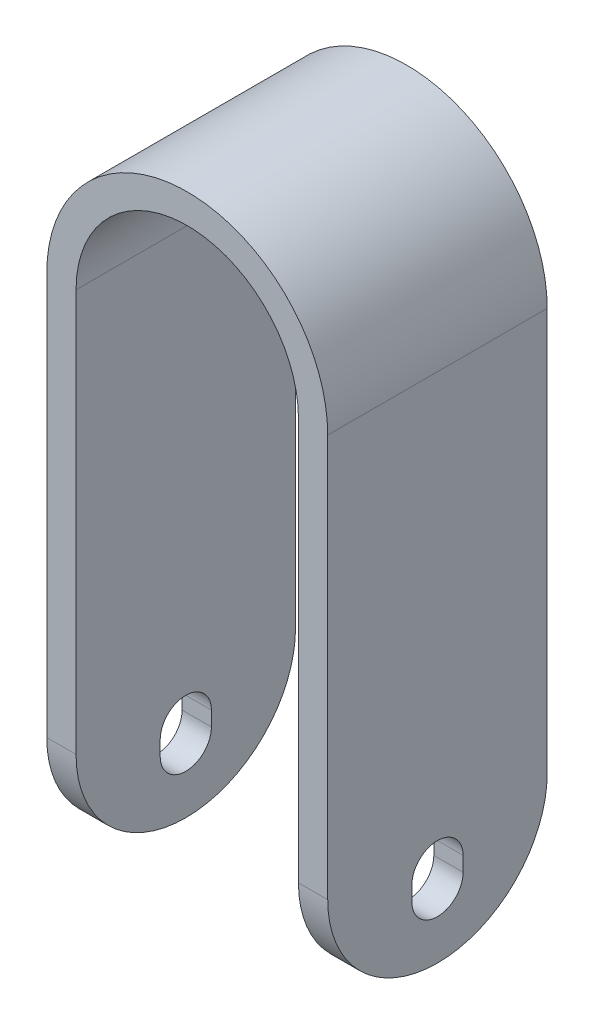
ISO-10303-21;
HEADER;
FILE_DESCRIPTION(('STEP AP214'),'2;1');
FILE_NAME('part.step','',(''),(''),'','','');
FILE_SCHEMA(('AUTOMOTIVE_DESIGN { 1 0 10303 214 1 1 1 1 }'));
ENDSEC;
DATA;
#1=APPLICATION_CONTEXT('core data for automotive mechanical design processes');
#2=APPLICATION_PROTOCOL_DEFINITION('international standard','automotive_design',2000,#1);
#3=PRODUCT_CONTEXT('',#1,'mechanical');
#4=PRODUCT('Part','Part','',(#3));
#5=PRODUCT_RELATED_PRODUCT_CATEGORY('part','',(#4));
#6=PRODUCT_DEFINITION_FORMATION('','',#4);
#7=PRODUCT_DEFINITION_CONTEXT('part definition',#1,'design');
#8=PRODUCT_DEFINITION('design','',#6,#7);
#9=PRODUCT_DEFINITION_SHAPE('','',#8);
#10=(LENGTH_UNIT() NAMED_UNIT(*) SI_UNIT(.MILLI.,.METRE.));
#11=(NAMED_UNIT(*) PLANE_ANGLE_UNIT() SI_UNIT($,.RADIAN.));
#12=(NAMED_UNIT(*) SI_UNIT($,.STERADIAN.) SOLID_ANGLE_UNIT());
#13=UNCERTAINTY_MEASURE_WITH_UNIT(LENGTH_MEASURE(1.E-05),#10,'distance_accuracy_value','');
#14=(GEOMETRIC_REPRESENTATION_CONTEXT(3) GLOBAL_UNCERTAINTY_ASSIGNED_CONTEXT((#13)) GLOBAL_UNIT_ASSIGNED_CONTEXT((#10,
#11,#12)) REPRESENTATION_CONTEXT('',''));
#15=CARTESIAN_POINT('',(0.,0.,0.));
#16=DIRECTION('',(0.,0.,1.));
#17=DIRECTION('',(1.,0.,0.));
#18=AXIS2_PLACEMENT_3D('',#15,#16,#17);
#19=CARTESIAN_POINT('',(-19.2,0.,30.));
#20=DIRECTION('',(1.,0.,0.));
#21=DIRECTION('',(0.,1.,0.));
#22=AXIS2_PLACEMENT_3D('',#19,#20,#21);
#23=PLANE('',#22);
#24=DIRECTION('',(0.,-1.,0.));
#25=VECTOR('',#24,1.);
#26=CARTESIAN_POINT('',(-19.2,0.,0.));
#27=LINE('',#26,#25);
#28=CARTESIAN_POINT('',(-19.2,0.,0.));
#29=VERTEX_POINT('',#28);
#30=CARTESIAN_POINT('',(-19.2,-55.,0.));
#31=VERTEX_POINT('',#30);
#32=EDGE_CURVE('E226',#29,#31,#27,.T.);
#33=ORIENTED_EDGE('',*,*,#32,.T.);
#34=CARTESIAN_POINT('',(-19.2,-55.,15.));
#35=DIRECTION('',(1.,0.,0.));
#36=DIRECTION('',(0.,1.,0.));
#37=AXIS2_PLACEMENT_3D('',#34,#35,#36);
#38=CIRCLE('',#37,15.);
#39=CARTESIAN_POINT('',(-19.2,-70.,15.));
#40=VERTEX_POINT('',#39);
#41=EDGE_CURVE('E11',#31,#40,#38,.F.);
#42=ORIENTED_EDGE('',*,*,#41,.T.);
#43=CARTESIAN_POINT('',(-19.2,-55.,15.));
#44=DIRECTION('',(1.,0.,0.));
#45=DIRECTION('',(0.,1.,0.));
#46=AXIS2_PLACEMENT_3D('',#43,#44,#45);
#47=CIRCLE('',#46,15.);
#48=CARTESIAN_POINT('',(-19.2,-55.,30.));
#49=VERTEX_POINT('',#48);
#50=EDGE_CURVE('E38',#40,#49,#47,.F.);
#51=ORIENTED_EDGE('',*,*,#50,.T.);
#52=DIRECTION('',(0.,-1.,0.));
#53=VECTOR('',#52,1.);
#54=CARTESIAN_POINT('',(-19.2,0.,30.));
#55=LINE('',#54,#53);
#56=CARTESIAN_POINT('',(-19.2,0.,30.));
#57=VERTEX_POINT('',#56);
#58=EDGE_CURVE('E244',#57,#49,#55,.T.);
#59=ORIENTED_EDGE('',*,*,#58,.F.);
#60=DIRECTION('',(0.,0.,-1.));
#61=VECTOR('',#60,1.);
#62=CARTESIAN_POINT('',(-19.2,0.,30.));
#63=LINE('',#62,#61);
#64=EDGE_CURVE('E265',#57,#29,#63,.T.);
#65=ORIENTED_EDGE('',*,*,#64,.T.);
#66=EDGE_LOOP('',(#33,#42,#51,#59,#65));
#67=FACE_BOUND('',#66,.T.);
#68=DIRECTION('',(0.,-1.,0.));
#69=VECTOR('',#68,1.);
#70=CARTESIAN_POINT('',(-19.2,0.,11.5));
#71=LINE('',#70,#69);
#72=CARTESIAN_POINT('',(-19.2,-59.,11.5));
#73=VERTEX_POINT('',#72);
#74=CARTESIAN_POINT('',(-19.2,-61.,11.5));
#75=VERTEX_POINT('',#74);
#76=EDGE_CURVE('E215',#73,#75,#71,.T.);
#77=ORIENTED_EDGE('',*,*,#76,.F.);
#78=CARTESIAN_POINT('',(-19.2,-59.,15.));
#79=DIRECTION('',(1.,0.,0.));
#80=DIRECTION('',(0.,1.,0.));
#81=AXIS2_PLACEMENT_3D('',#78,#79,#80);
#82=CIRCLE('',#81,3.5);
#83=CARTESIAN_POINT('',(-19.2,-59.,18.5));
#84=VERTEX_POINT('',#83);
#85=EDGE_CURVE('E206',#73,#84,#82,.T.);
#86=ORIENTED_EDGE('',*,*,#85,.T.);
#87=DIRECTION('',(0.,-1.,0.));
#88=VECTOR('',#87,1.);
#89=CARTESIAN_POINT('',(-19.2,0.,18.5000000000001));
#90=LINE('',#89,#88);
#91=CARTESIAN_POINT('',(-19.2,-61.,18.5));
#92=VERTEX_POINT('',#91);
#93=EDGE_CURVE('E199',#84,#92,#90,.T.);
#94=ORIENTED_EDGE('',*,*,#93,.T.);
#95=CARTESIAN_POINT('',(-19.2,-61.,15.));
#96=DIRECTION('',(1.,0.,0.));
#97=DIRECTION('',(0.,1.,0.));
#98=AXIS2_PLACEMENT_3D('',#95,#96,#97);
#99=CIRCLE('',#98,3.5);
#100=EDGE_CURVE('E193',#92,#75,#99,.T.);
#101=ORIENTED_EDGE('',*,*,#100,.T.);
#102=EDGE_LOOP('',(#77,#86,#94,#101));
#103=FACE_BOUND('',#102,.T.);
#104=ADVANCED_FACE('F30',(#67,#103),#23,.F.);
#105=CARTESIAN_POINT('',(-15.2,0.,30.));
#106=DIRECTION('',(1.,0.,0.));
#107=DIRECTION('',(0.,1.,0.));
#108=AXIS2_PLACEMENT_3D('',#105,#106,#107);
#109=PLANE('',#108);
#110=CARTESIAN_POINT('',(-15.2,-55.,15.));
#111=DIRECTION('',(1.,0.,0.));
#112=DIRECTION('',(0.,1.,0.));
#113=AXIS2_PLACEMENT_3D('',#110,#111,#112);
#114=CIRCLE('',#113,15.);
#115=CARTESIAN_POINT('',(-15.2,-55.,30.));
#116=VERTEX_POINT('',#115);
#117=CARTESIAN_POINT('',(-15.2,-70.,15.));
#118=VERTEX_POINT('',#117);
#119=EDGE_CURVE('E286',#116,#118,#114,.T.);
#120=ORIENTED_EDGE('',*,*,#119,.T.);
#121=CARTESIAN_POINT('',(-15.2,-55.,15.));
#122=DIRECTION('',(1.,0.,0.));
#123=DIRECTION('',(0.,1.,0.));
#124=AXIS2_PLACEMENT_3D('',#121,#122,#123);
#125=CIRCLE('',#124,15.);
#126=CARTESIAN_POINT('',(-15.2,-55.,0.));
#127=VERTEX_POINT('',#126);
#128=EDGE_CURVE('E288',#118,#127,#125,.T.);
#129=ORIENTED_EDGE('',*,*,#128,.T.);
#130=DIRECTION('',(0.,-1.,0.));
#131=VECTOR('',#130,1.);
#132=CARTESIAN_POINT('',(-15.2,0.,0.));
#133=LINE('',#132,#131);
#134=CARTESIAN_POINT('',(-15.2,0.,0.));
#135=VERTEX_POINT('',#134);
#136=EDGE_CURVE('E229',#135,#127,#133,.T.);
#137=ORIENTED_EDGE('',*,*,#136,.F.);
#138=DIRECTION('',(0.,0.,-1.));
#139=VECTOR('',#138,1.);
#140=CARTESIAN_POINT('',(-15.2,0.,30.));
#141=LINE('',#140,#139);
#142=CARTESIAN_POINT('',(-15.2,0.,30.));
#143=VERTEX_POINT('',#142);
#144=EDGE_CURVE('E263',#143,#135,#141,.T.);
#145=ORIENTED_EDGE('',*,*,#144,.F.);
#146=DIRECTION('',(0.,-1.,0.));
#147=VECTOR('',#146,1.);
#148=CARTESIAN_POINT('',(-15.2,0.,30.));
#149=LINE('',#148,#147);
#150=EDGE_CURVE('E247',#143,#116,#149,.T.);
#151=ORIENTED_EDGE('',*,*,#150,.T.);
#152=EDGE_LOOP('',(#120,#129,#137,#145,#151));
#153=FACE_BOUND('',#152,.T.);
#154=CARTESIAN_POINT('',(-15.2,-59.,15.));
#155=DIRECTION('',(1.,0.,0.));
#156=DIRECTION('',(0.,1.,0.));
#157=AXIS2_PLACEMENT_3D('',#154,#155,#156);
#158=CIRCLE('',#157,3.5);
#159=CARTESIAN_POINT('',(-15.2,-59.,11.5));
#160=VERTEX_POINT('',#159);
#161=CARTESIAN_POINT('',(-15.2,-59.,18.5));
#162=VERTEX_POINT('',#161);
#163=EDGE_CURVE('E204',#160,#162,#158,.T.);
#164=ORIENTED_EDGE('',*,*,#163,.F.);
#165=DIRECTION('',(0.,-1.,0.));
#166=VECTOR('',#165,1.);
#167=CARTESIAN_POINT('',(-15.2,0.,11.5));
#168=LINE('',#167,#166);
#169=CARTESIAN_POINT('',(-15.2,-61.,11.5));
#170=VERTEX_POINT('',#169);
#171=EDGE_CURVE('E212',#160,#170,#168,.T.);
#172=ORIENTED_EDGE('',*,*,#171,.T.);
#173=CARTESIAN_POINT('',(-15.2,-61.,15.));
#174=DIRECTION('',(1.,0.,0.));
#175=DIRECTION('',(0.,1.,0.));
#176=AXIS2_PLACEMENT_3D('',#173,#174,#175);
#177=CIRCLE('',#176,3.5);
#178=CARTESIAN_POINT('',(-15.2,-61.,18.5));
#179=VERTEX_POINT('',#178);
#180=EDGE_CURVE('E191',#179,#170,#177,.T.);
#181=ORIENTED_EDGE('',*,*,#180,.F.);
#182=DIRECTION('',(0.,-1.,0.));
#183=VECTOR('',#182,1.);
#184=CARTESIAN_POINT('',(-15.2,0.,18.5000000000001));
#185=LINE('',#184,#183);
#186=EDGE_CURVE('E197',#162,#179,#185,.T.);
#187=ORIENTED_EDGE('',*,*,#186,.F.);
#188=EDGE_LOOP('',(#164,#172,#181,#187));
#189=FACE_BOUND('',#188,.T.);
#190=ADVANCED_FACE('F305',(#153,#189),#109,.T.);
#191=CARTESIAN_POINT('',(15.2,0.,30.));
#192=DIRECTION('',(1.,0.,0.));
#193=DIRECTION('',(0.,1.,0.));
#194=AXIS2_PLACEMENT_3D('',#191,#192,#193);
#195=PLANE('',#194);
#196=CARTESIAN_POINT('',(15.2,-55.,15.));
#197=DIRECTION('',(1.,0.,0.));
#198=DIRECTION('',(0.,1.,0.));
#199=AXIS2_PLACEMENT_3D('',#196,#197,#198);
#200=CIRCLE('',#199,15.);
#201=CARTESIAN_POINT('',(15.2,-55.,0.));
#202=VERTEX_POINT('',#201);
#203=CARTESIAN_POINT('',(15.2,-70.,15.));
#204=VERTEX_POINT('',#203);
#205=EDGE_CURVE('E277',#202,#204,#200,.F.);
#206=ORIENTED_EDGE('',*,*,#205,.T.);
#207=CARTESIAN_POINT('',(15.2,-55.,15.));
#208=DIRECTION('',(1.,0.,0.));
#209=DIRECTION('',(0.,1.,0.));
#210=AXIS2_PLACEMENT_3D('',#207,#208,#209);
#211=CIRCLE('',#210,15.);
#212=CARTESIAN_POINT('',(15.2,-55.,30.));
#213=VERTEX_POINT('',#212);
#214=EDGE_CURVE('E279',#204,#213,#211,.F.);
#215=ORIENTED_EDGE('',*,*,#214,.T.);
#216=DIRECTION('',(0.,-1.,0.));
#217=VECTOR('',#216,1.);
#218=CARTESIAN_POINT('',(15.2,0.,30.));
#219=LINE('',#218,#217);
#220=CARTESIAN_POINT('',(15.2,0.,30.));
#221=VERTEX_POINT('',#220);
#222=EDGE_CURVE('E253',#221,#213,#219,.T.);
#223=ORIENTED_EDGE('',*,*,#222,.F.);
#224=DIRECTION('',(0.,0.,-1.));
#225=VECTOR('',#224,1.);
#226=CARTESIAN_POINT('',(15.2,0.,30.));
#227=LINE('',#226,#225);
#228=CARTESIAN_POINT('',(15.2,0.,0.));
#229=VERTEX_POINT('',#228);
#230=EDGE_CURVE('E261',#221,#229,#227,.T.);
#231=ORIENTED_EDGE('',*,*,#230,.T.);
#232=DIRECTION('',(0.,-1.,0.));
#233=VECTOR('',#232,1.);
#234=CARTESIAN_POINT('',(15.2,0.,0.));
#235=LINE('',#234,#233);
#236=EDGE_CURVE('E235',#229,#202,#235,.T.);
#237=ORIENTED_EDGE('',*,*,#236,.T.);
#238=EDGE_LOOP('',(#206,#215,#223,#231,#237));
#239=FACE_BOUND('',#238,.T.);
#240=DIRECTION('',(0.,-1.,0.));
#241=VECTOR('',#240,1.);
#242=CARTESIAN_POINT('',(15.2,0.,11.5));
#243=LINE('',#242,#241);
#244=CARTESIAN_POINT('',(15.2,-59.,11.5));
#245=VERTEX_POINT('',#244);
#246=CARTESIAN_POINT('',(15.2,-61.,11.5));
#247=VERTEX_POINT('',#246);
#248=EDGE_CURVE('E209',#245,#247,#243,.T.);
#249=ORIENTED_EDGE('',*,*,#248,.F.);
#250=CARTESIAN_POINT('',(15.2,-59.,15.));
#251=DIRECTION('',(1.,0.,0.));
#252=DIRECTION('',(0.,1.,0.));
#253=AXIS2_PLACEMENT_3D('',#250,#251,#252);
#254=CIRCLE('',#253,3.5);
#255=CARTESIAN_POINT('',(15.2,-59.,18.5));
#256=VERTEX_POINT('',#255);
#257=EDGE_CURVE('E202',#245,#256,#254,.T.);
#258=ORIENTED_EDGE('',*,*,#257,.T.);
#259=DIRECTION('',(0.,-1.,0.));
#260=VECTOR('',#259,1.);
#261=CARTESIAN_POINT('',(15.2,0.,18.5000000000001));
#262=LINE('',#261,#260);
#263=CARTESIAN_POINT('',(15.2,-61.,18.5));
#264=VERTEX_POINT('',#263);
#265=EDGE_CURVE('E158',#256,#264,#262,.T.);
#266=ORIENTED_EDGE('',*,*,#265,.T.);
#267=CARTESIAN_POINT('',(15.2,-61.,15.));
#268=DIRECTION('',(1.,0.,0.));
#269=DIRECTION('',(0.,1.,0.));
#270=AXIS2_PLACEMENT_3D('',#267,#268,#269);
#271=CIRCLE('',#270,3.5);
#272=EDGE_CURVE('E188',#264,#247,#271,.T.);
#273=ORIENTED_EDGE('',*,*,#272,.T.);
#274=EDGE_LOOP('',(#249,#258,#266,#273));
#275=FACE_BOUND('',#274,.T.);
#276=ADVANCED_FACE('F315',(#239,#275),#195,.F.);
#277=CARTESIAN_POINT('',(19.2,0.,30.));
#278=DIRECTION('',(1.,0.,0.));
#279=DIRECTION('',(0.,1.,0.));
#280=AXIS2_PLACEMENT_3D('',#277,#278,#279);
#281=PLANE('',#280);
#282=DIRECTION('',(0.,-1.,0.));
#283=VECTOR('',#282,1.);
#284=CARTESIAN_POINT('',(19.2,0.,30.));
#285=LINE('',#284,#283);
#286=CARTESIAN_POINT('',(19.2,0.,30.));
#287=VERTEX_POINT('',#286);
#288=CARTESIAN_POINT('',(19.2,-55.,30.));
#289=VERTEX_POINT('',#288);
#290=EDGE_CURVE('E256',#287,#289,#285,.T.);
#291=ORIENTED_EDGE('',*,*,#290,.T.);
#292=CARTESIAN_POINT('',(19.2,-55.,15.));
#293=DIRECTION('',(1.,0.,0.));
#294=DIRECTION('',(0.,1.,0.));
#295=AXIS2_PLACEMENT_3D('',#292,#293,#294);
#296=CIRCLE('',#295,15.);
#297=CARTESIAN_POINT('',(19.2,-70.,15.));
#298=VERTEX_POINT('',#297);
#299=EDGE_CURVE('E275',#289,#298,#296,.T.);
#300=ORIENTED_EDGE('',*,*,#299,.T.);
#301=CARTESIAN_POINT('',(19.2,-55.,15.));
#302=DIRECTION('',(1.,0.,0.));
#303=DIRECTION('',(0.,1.,0.));
#304=AXIS2_PLACEMENT_3D('',#301,#302,#303);
#305=CIRCLE('',#304,15.);
#306=CARTESIAN_POINT('',(19.2,-55.,0.));
#307=VERTEX_POINT('',#306);
#308=EDGE_CURVE('E273',#298,#307,#305,.T.);
#309=ORIENTED_EDGE('',*,*,#308,.T.);
#310=DIRECTION('',(0.,-1.,0.));
#311=VECTOR('',#310,1.);
#312=CARTESIAN_POINT('',(19.2,0.,0.));
#313=LINE('',#312,#311);
#314=CARTESIAN_POINT('',(19.2,0.,0.));
#315=VERTEX_POINT('',#314);
#316=EDGE_CURVE('E238',#315,#307,#313,.T.);
#317=ORIENTED_EDGE('',*,*,#316,.F.);
#318=DIRECTION('',(0.,0.,-1.));
#319=VECTOR('',#318,1.);
#320=CARTESIAN_POINT('',(19.2,0.,30.));
#321=LINE('',#320,#319);
#322=EDGE_CURVE('E259',#287,#315,#321,.T.);
#323=ORIENTED_EDGE('',*,*,#322,.F.);
#324=EDGE_LOOP('',(#291,#300,#309,#317,#323));
#325=FACE_BOUND('',#324,.T.);
#326=CARTESIAN_POINT('',(19.2,-59.,15.));
#327=DIRECTION('',(1.,0.,0.));
#328=DIRECTION('',(0.,1.,0.));
#329=AXIS2_PLACEMENT_3D('',#326,#327,#328);
#330=CIRCLE('',#329,3.5);
#331=CARTESIAN_POINT('',(19.2,-59.,11.5));
#332=VERTEX_POINT('',#331);
#333=CARTESIAN_POINT('',(19.2,-59.,18.5));
#334=VERTEX_POINT('',#333);
#335=EDGE_CURVE('E165',#332,#334,#330,.T.);
#336=ORIENTED_EDGE('',*,*,#335,.F.);
#337=DIRECTION('',(0.,-1.,0.));
#338=VECTOR('',#337,1.);
#339=CARTESIAN_POINT('',(19.2,-59.,11.5));
#340=LINE('',#339,#338);
#341=CARTESIAN_POINT('',(19.2,-61.,11.5));
#342=VERTEX_POINT('',#341);
#343=EDGE_CURVE('E162',#332,#342,#340,.T.);
#344=ORIENTED_EDGE('',*,*,#343,.T.);
#345=CARTESIAN_POINT('',(19.2,-61.,15.));
#346=DIRECTION('',(1.,0.,0.));
#347=DIRECTION('',(0.,1.,0.));
#348=AXIS2_PLACEMENT_3D('',#345,#346,#347);
#349=CIRCLE('',#348,3.5);
#350=CARTESIAN_POINT('',(19.2,-61.,18.5));
#351=VERTEX_POINT('',#350);
#352=EDGE_CURVE('E176',#351,#342,#349,.T.);
#353=ORIENTED_EDGE('',*,*,#352,.F.);
#354=DIRECTION('',(0.,-1.,0.));
#355=VECTOR('',#354,1.);
#356=CARTESIAN_POINT('',(19.2,-59.,18.5));
#357=LINE('',#356,#355);
#358=EDGE_CURVE('E155',#334,#351,#357,.T.);
#359=ORIENTED_EDGE('',*,*,#358,.F.);
#360=EDGE_LOOP('',(#336,#344,#353,#359));
#361=FACE_BOUND('',#360,.T.);
#362=ADVANCED_FACE('F174',(#325,#361),#281,.T.);
#363=CARTESIAN_POINT('',(0.,0.,30.));
#364=DIRECTION('',(0.,0.,-1.));
#365=DIRECTION('',(-1.,0.,0.));
#366=AXIS2_PLACEMENT_3D('',#363,#364,#365);
#367=CYLINDRICAL_SURFACE('',#366,19.2);
#368=CARTESIAN_POINT('',(0.,0.,0.));
#369=DIRECTION('',(0.,0.,1.));
#370=DIRECTION('',(1.,0.,0.));
#371=AXIS2_PLACEMENT_3D('',#368,#369,#370);
#372=CIRCLE('',#371,19.2);
#373=EDGE_CURVE('E223',#315,#29,#372,.T.);
#374=ORIENTED_EDGE('',*,*,#373,.T.);
#375=ORIENTED_EDGE('',*,*,#64,.F.);
#376=CARTESIAN_POINT('',(0.,0.,30.));
#377=DIRECTION('',(0.,0.,1.));
#378=DIRECTION('',(1.,0.,0.));
#379=AXIS2_PLACEMENT_3D('',#376,#377,#378);
#380=CIRCLE('',#379,19.2);
#381=EDGE_CURVE('E241',#287,#57,#380,.T.);
#382=ORIENTED_EDGE('',*,*,#381,.F.);
#383=ORIENTED_EDGE('',*,*,#322,.T.);
#384=EDGE_LOOP('',(#374,#375,#382,#383));
#385=FACE_BOUND('',#384,.T.);
#386=ADVANCED_FACE('F32',(#385),#367,.T.);
#387=CARTESIAN_POINT('',(0.,0.,30.));
#388=DIRECTION('',(0.,0.,-1.));
#389=DIRECTION('',(-1.,0.,0.));
#390=AXIS2_PLACEMENT_3D('',#387,#388,#389);
#391=CYLINDRICAL_SURFACE('',#390,15.2);
#392=CARTESIAN_POINT('',(0.,0.,0.));
#393=DIRECTION('',(0.,0.,1.));
#394=DIRECTION('',(1.,0.,0.));
#395=AXIS2_PLACEMENT_3D('',#392,#393,#394);
#396=CIRCLE('',#395,15.2);
#397=EDGE_CURVE('E232',#229,#135,#396,.T.);
#398=ORIENTED_EDGE('',*,*,#397,.F.);
#399=ORIENTED_EDGE('',*,*,#230,.F.);
#400=CARTESIAN_POINT('',(0.,0.,30.));
#401=DIRECTION('',(0.,0.,1.));
#402=DIRECTION('',(1.,0.,0.));
#403=AXIS2_PLACEMENT_3D('',#400,#401,#402);
#404=CIRCLE('',#403,15.2);
#405=EDGE_CURVE('E250',#221,#143,#404,.T.);
#406=ORIENTED_EDGE('',*,*,#405,.T.);
#407=ORIENTED_EDGE('',*,*,#144,.T.);
#408=EDGE_LOOP('',(#398,#399,#406,#407));
#409=FACE_BOUND('',#408,.T.);
#410=ADVANCED_FACE('F311',(#409),#391,.F.);
#411=CARTESIAN_POINT('',(0.,0.,30.));
#412=DIRECTION('',(0.,0.,1.));
#413=DIRECTION('',(1.,0.,0.));
#414=AXIS2_PLACEMENT_3D('',#411,#412,#413);
#415=PLANE('',#414);
#416=ORIENTED_EDGE('',*,*,#222,.T.);
#417=DIRECTION('',(1.,0.,0.));
#418=VECTOR('',#417,1.);
#419=CARTESIAN_POINT('',(19.2,-55.,30.));
#420=LINE('',#419,#418);
#421=EDGE_CURVE('E270',#213,#289,#420,.T.);
#422=ORIENTED_EDGE('',*,*,#421,.T.);
#423=ORIENTED_EDGE('',*,*,#290,.F.);
#424=ORIENTED_EDGE('',*,*,#381,.T.);
#425=ORIENTED_EDGE('',*,*,#58,.T.);
#426=DIRECTION('',(1.,0.,0.));
#427=VECTOR('',#426,1.);
#428=CARTESIAN_POINT('',(-15.2,-55.,30.));
#429=LINE('',#428,#427);
#430=EDGE_CURVE('E268',#49,#116,#429,.T.);
#431=ORIENTED_EDGE('',*,*,#430,.T.);
#432=ORIENTED_EDGE('',*,*,#150,.F.);
#433=ORIENTED_EDGE('',*,*,#405,.F.);
#434=EDGE_LOOP('',(#416,#422,#423,#424,#425,#431,#432,#433));
#435=FACE_BOUND('',#434,.T.);
#436=ADVANCED_FACE('F296',(#435),#415,.T.);
#437=CARTESIAN_POINT('',(0.,0.,0.));
#438=DIRECTION('',(0.,0.,1.));
#439=DIRECTION('',(1.,0.,0.));
#440=AXIS2_PLACEMENT_3D('',#437,#438,#439);
#441=PLANE('',#440);
#442=ORIENTED_EDGE('',*,*,#316,.T.);
#443=DIRECTION('',(1.,0.,0.));
#444=VECTOR('',#443,1.);
#445=CARTESIAN_POINT('',(0.,-55.,0.));
#446=LINE('',#445,#444);
#447=EDGE_CURVE('E284',#307,#202,#446,.F.);
#448=ORIENTED_EDGE('',*,*,#447,.T.);
#449=ORIENTED_EDGE('',*,*,#236,.F.);
#450=ORIENTED_EDGE('',*,*,#397,.T.);
#451=ORIENTED_EDGE('',*,*,#136,.T.);
#452=DIRECTION('',(1.,0.,0.));
#453=VECTOR('',#452,1.);
#454=CARTESIAN_POINT('',(0.,-55.,0.));
#455=LINE('',#454,#453);
#456=EDGE_CURVE('E281',#127,#31,#455,.F.);
#457=ORIENTED_EDGE('',*,*,#456,.T.);
#458=ORIENTED_EDGE('',*,*,#32,.F.);
#459=ORIENTED_EDGE('',*,*,#373,.F.);
#460=EDGE_LOOP('',(#442,#448,#449,#450,#451,#457,#458,#459));
#461=FACE_BOUND('',#460,.T.);
#462=ADVANCED_FACE('F330',(#461),#441,.F.);
#463=CARTESIAN_POINT('',(15.2,-55.,15.));
#464=DIRECTION('',(1.,0.,0.));
#465=DIRECTION('',(0.,0.,-1.));
#466=AXIS2_PLACEMENT_3D('',#463,#464,#465);
#467=CYLINDRICAL_SURFACE('',#466,15.);
#468=DIRECTION('',(1.,0.,0.));
#469=VECTOR('',#468,1.);
#470=CARTESIAN_POINT('',(15.2,-70.,15.));
#471=LINE('',#470,#469);
#472=EDGE_CURVE('E220',#204,#298,#471,.T.);
#473=ORIENTED_EDGE('',*,*,#472,.F.);
#474=ORIENTED_EDGE('',*,*,#205,.F.);
#475=ORIENTED_EDGE('',*,*,#447,.F.);
#476=ORIENTED_EDGE('',*,*,#308,.F.);
#477=EDGE_LOOP('',(#473,#474,#475,#476));
#478=FACE_BOUND('',#477,.T.);
#479=ADVANCED_FACE('F327',(#478),#467,.T.);
#480=CARTESIAN_POINT('',(0.,-55.,15.));
#481=DIRECTION('',(-1.,0.,0.));
#482=DIRECTION('',(0.,0.,1.));
#483=AXIS2_PLACEMENT_3D('',#480,#481,#482);
#484=CYLINDRICAL_SURFACE('',#483,15.);
#485=ORIENTED_EDGE('',*,*,#214,.F.);
#486=ORIENTED_EDGE('',*,*,#472,.T.);
#487=ORIENTED_EDGE('',*,*,#299,.F.);
#488=ORIENTED_EDGE('',*,*,#421,.F.);
#489=EDGE_LOOP('',(#485,#486,#487,#488));
#490=FACE_BOUND('',#489,.T.);
#491=ADVANCED_FACE('F320',(#490),#484,.T.);
#492=CARTESIAN_POINT('',(0.,-55.,15.));
#493=DIRECTION('',(-1.,0.,0.));
#494=DIRECTION('',(0.,0.,1.));
#495=AXIS2_PLACEMENT_3D('',#492,#493,#494);
#496=CYLINDRICAL_SURFACE('',#495,15.);
#497=ORIENTED_EDGE('',*,*,#430,.F.);
#498=ORIENTED_EDGE('',*,*,#50,.F.);
#499=DIRECTION('',(1.,0.,0.));
#500=VECTOR('',#499,1.);
#501=CARTESIAN_POINT('',(-19.2,-70.,15.));
#502=LINE('',#501,#500);
#503=EDGE_CURVE('E217',#118,#40,#502,.F.);
#504=ORIENTED_EDGE('',*,*,#503,.F.);
#505=ORIENTED_EDGE('',*,*,#119,.F.);
#506=EDGE_LOOP('',(#497,#498,#504,#505));
#507=FACE_BOUND('',#506,.T.);
#508=ADVANCED_FACE('F302',(#507),#496,.T.);
#509=CARTESIAN_POINT('',(-19.2,-55.,15.));
#510=DIRECTION('',(1.,0.,0.));
#511=DIRECTION('',(0.,0.,-1.));
#512=AXIS2_PLACEMENT_3D('',#509,#510,#511);
#513=CYLINDRICAL_SURFACE('',#512,15.);
#514=ORIENTED_EDGE('',*,*,#41,.F.);
#515=ORIENTED_EDGE('',*,*,#456,.F.);
#516=ORIENTED_EDGE('',*,*,#128,.F.);
#517=ORIENTED_EDGE('',*,*,#503,.T.);
#518=EDGE_LOOP('',(#514,#515,#516,#517));
#519=FACE_BOUND('',#518,.T.);
#520=ADVANCED_FACE('F335',(#519),#513,.T.);
#521=CARTESIAN_POINT('',(-30.8,-61.,15.));
#522=DIRECTION('',(1.,0.,0.));
#523=DIRECTION('',(0.,1.,0.));
#524=AXIS2_PLACEMENT_3D('',#521,#522,#523);
#525=CYLINDRICAL_SURFACE('',#524,3.5);
#526=DIRECTION('',(1.,0.,0.));
#527=VECTOR('',#526,1.);
#528=CARTESIAN_POINT('',(-30.8,-61.,18.5));
#529=LINE('',#528,#527);
#530=EDGE_CURVE('E186',#264,#351,#529,.T.);
#531=ORIENTED_EDGE('',*,*,#530,.T.);
#532=ORIENTED_EDGE('',*,*,#352,.T.);
#533=DIRECTION('',(1.,0.,0.));
#534=VECTOR('',#533,1.);
#535=CARTESIAN_POINT('',(-30.8,-61.,11.5));
#536=LINE('',#535,#534);
#537=EDGE_CURVE('E184',#247,#342,#536,.T.);
#538=ORIENTED_EDGE('',*,*,#537,.F.);
#539=ORIENTED_EDGE('',*,*,#272,.F.);
#540=EDGE_LOOP('',(#531,#532,#538,#539));
#541=FACE_BOUND('',#540,.T.);
#542=ADVANCED_FACE('F337',(#541),#525,.F.);
#543=CARTESIAN_POINT('',(-30.8,-59.,18.5));
#544=DIRECTION('',(0.,0.,1.));
#545=DIRECTION('',(0.,-1.,0.));
#546=AXIS2_PLACEMENT_3D('',#543,#544,#545);
#547=PLANE('',#546);
#548=DIRECTION('',(1.,0.,0.));
#549=VECTOR('',#548,1.);
#550=CARTESIAN_POINT('',(-30.8,-59.,18.5));
#551=LINE('',#550,#549);
#552=EDGE_CURVE('E150',#256,#334,#551,.T.);
#553=ORIENTED_EDGE('',*,*,#552,.T.);
#554=ORIENTED_EDGE('',*,*,#358,.T.);
#555=ORIENTED_EDGE('',*,*,#530,.F.);
#556=ORIENTED_EDGE('',*,*,#265,.F.);
#557=EDGE_LOOP('',(#553,#554,#555,#556));
#558=FACE_BOUND('',#557,.T.);
#559=ADVANCED_FACE('F152',(#558),#547,.F.);
#560=CARTESIAN_POINT('',(-30.8,-59.,15.));
#561=DIRECTION('',(1.,0.,0.));
#562=DIRECTION('',(0.,1.,0.));
#563=AXIS2_PLACEMENT_3D('',#560,#561,#562);
#564=CYLINDRICAL_SURFACE('',#563,3.5);
#565=DIRECTION('',(1.,0.,0.));
#566=VECTOR('',#565,1.);
#567=CARTESIAN_POINT('',(-30.8,-59.,11.5));
#568=LINE('',#567,#566);
#569=EDGE_CURVE('E168',#245,#332,#568,.T.);
#570=ORIENTED_EDGE('',*,*,#569,.T.);
#571=ORIENTED_EDGE('',*,*,#335,.T.);
#572=ORIENTED_EDGE('',*,*,#552,.F.);
#573=ORIENTED_EDGE('',*,*,#257,.F.);
#574=EDGE_LOOP('',(#570,#571,#572,#573));
#575=FACE_BOUND('',#574,.T.);
#576=ADVANCED_FACE('F166',(#575),#564,.F.);
#577=CARTESIAN_POINT('',(-30.8,-59.,11.5));
#578=DIRECTION('',(0.,0.,1.));
#579=DIRECTION('',(1.,0.,0.));
#580=AXIS2_PLACEMENT_3D('',#577,#578,#579);
#581=PLANE('',#580);
#582=ORIENTED_EDGE('',*,*,#248,.T.);
#583=ORIENTED_EDGE('',*,*,#537,.T.);
#584=ORIENTED_EDGE('',*,*,#343,.F.);
#585=ORIENTED_EDGE('',*,*,#569,.F.);
#586=EDGE_LOOP('',(#582,#583,#584,#585));
#587=FACE_BOUND('',#586,.T.);
#588=ADVANCED_FACE('F429',(#587),#581,.T.);
#589=ORIENTED_EDGE('',*,*,#76,.T.);
#590=EDGE_CURVE('E183',#75,#170,#536,.T.);
#591=ORIENTED_EDGE('',*,*,#590,.T.);
#592=ORIENTED_EDGE('',*,*,#171,.F.);
#593=EDGE_CURVE('E182',#73,#160,#568,.T.);
#594=ORIENTED_EDGE('',*,*,#593,.F.);
#595=EDGE_LOOP('',(#589,#591,#592,#594));
#596=FACE_BOUND('',#595,.T.);
#597=ADVANCED_FACE('F438',(#596),#581,.T.);
#598=ORIENTED_EDGE('',*,*,#593,.T.);
#599=ORIENTED_EDGE('',*,*,#163,.T.);
#600=EDGE_CURVE('E161',#84,#162,#551,.T.);
#601=ORIENTED_EDGE('',*,*,#600,.F.);
#602=ORIENTED_EDGE('',*,*,#85,.F.);
#603=EDGE_LOOP('',(#598,#599,#601,#602));
#604=FACE_BOUND('',#603,.T.);
#605=ADVANCED_FACE('F430',(#604),#564,.F.);
#606=ORIENTED_EDGE('',*,*,#600,.T.);
#607=ORIENTED_EDGE('',*,*,#186,.T.);
#608=EDGE_CURVE('E45',#92,#179,#529,.T.);
#609=ORIENTED_EDGE('',*,*,#608,.F.);
#610=ORIENTED_EDGE('',*,*,#93,.F.);
#611=EDGE_LOOP('',(#606,#607,#609,#610));
#612=FACE_BOUND('',#611,.T.);
#613=ADVANCED_FACE('F421',(#612),#547,.F.);
#614=ORIENTED_EDGE('',*,*,#608,.T.);
#615=ORIENTED_EDGE('',*,*,#180,.T.);
#616=ORIENTED_EDGE('',*,*,#590,.F.);
#617=ORIENTED_EDGE('',*,*,#100,.F.);
#618=EDGE_LOOP('',(#614,#615,#616,#617));
#619=FACE_BOUND('',#618,.T.);
#620=ADVANCED_FACE('F345',(#619),#525,.F.);
#621=CLOSED_SHELL('',(#104,#190,#276,#362,#386,#410,#436,#462,#479,#491,#508,#520,#542,#559,
#576,#588,#597,#605,#613,#620));
#622=MANIFOLD_SOLID_BREP('B2',#621);
#623=ADVANCED_BREP_SHAPE_REPRESENTATION('',(#18,#622),#14);
#624=SHAPE_DEFINITION_REPRESENTATION(#9,#623);
ENDSEC;
END-ISO-10303-21;
